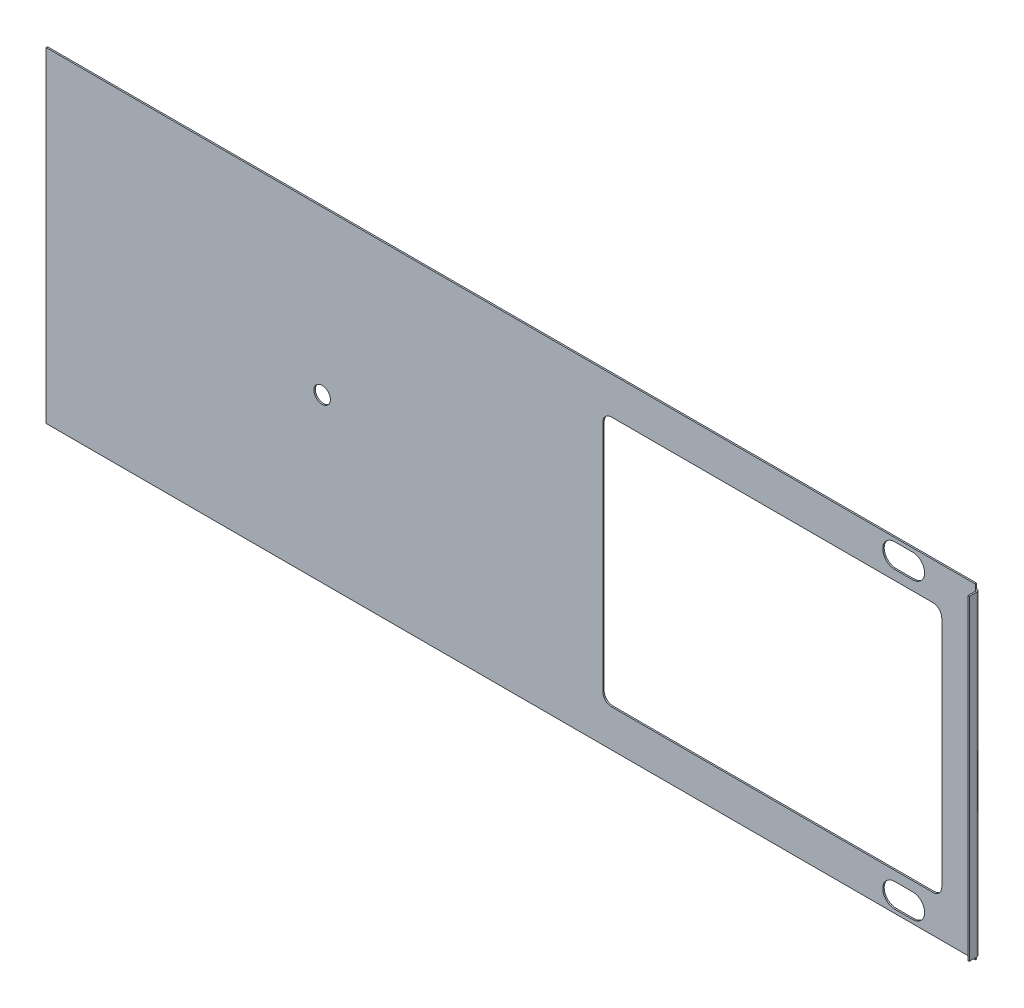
ISO-10303-21;
HEADER;
FILE_DESCRIPTION(('STEP AP214'),'2;1');
FILE_NAME('part.step','',(''),(''),'','','');
FILE_SCHEMA(('AUTOMOTIVE_DESIGN { 1 0 10303 214 1 1 1 1 }'));
ENDSEC;
DATA;
#1=APPLICATION_CONTEXT('core data for automotive mechanical design processes');
#2=APPLICATION_PROTOCOL_DEFINITION('international standard','automotive_design',2000,#1);
#3=PRODUCT_CONTEXT('',#1,'mechanical');
#4=PRODUCT('Part','Part','',(#3));
#5=PRODUCT_RELATED_PRODUCT_CATEGORY('part','',(#4));
#6=PRODUCT_DEFINITION_FORMATION('','',#4);
#7=PRODUCT_DEFINITION_CONTEXT('part definition',#1,'design');
#8=PRODUCT_DEFINITION('design','',#6,#7);
#9=PRODUCT_DEFINITION_SHAPE('','',#8);
#10=(LENGTH_UNIT() NAMED_UNIT(*) SI_UNIT(.MILLI.,.METRE.));
#11=(NAMED_UNIT(*) PLANE_ANGLE_UNIT() SI_UNIT($,.RADIAN.));
#12=(NAMED_UNIT(*) SI_UNIT($,.STERADIAN.) SOLID_ANGLE_UNIT());
#13=UNCERTAINTY_MEASURE_WITH_UNIT(LENGTH_MEASURE(1.E-05),#10,'distance_accuracy_value','');
#14=(GEOMETRIC_REPRESENTATION_CONTEXT(3) GLOBAL_UNCERTAINTY_ASSIGNED_CONTEXT((#13)) GLOBAL_UNIT_ASSIGNED_CONTEXT((#10,
#11,#12)) REPRESENTATION_CONTEXT('',''));
#15=CARTESIAN_POINT('',(0.,0.,0.));
#16=DIRECTION('',(0.,0.,1.));
#17=DIRECTION('',(1.,0.,0.));
#18=AXIS2_PLACEMENT_3D('',#15,#16,#17);
#19=CARTESIAN_POINT('',(1842.4525,33.3375,0.));
#20=DIRECTION('',(0.,0.,1.));
#21=DIRECTION('',(1.,0.,0.));
#22=AXIS2_PLACEMENT_3D('',#19,#20,#21);
#23=CYLINDRICAL_SURFACE('',#22,25.4);
#24=DIRECTION('',(0.,0.,1.));
#25=VECTOR('',#24,1.);
#26=CARTESIAN_POINT('',(1842.4525,7.93750000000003,0.));
#27=LINE('',#26,#25);
#28=CARTESIAN_POINT('',(1842.4525,7.93750000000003,0.));
#29=VERTEX_POINT('',#28);
#30=CARTESIAN_POINT('',(1842.4525,7.93750000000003,3.048));
#31=VERTEX_POINT('',#30);
#32=EDGE_CURVE('E320',#29,#31,#27,.T.);
#33=ORIENTED_EDGE('',*,*,#32,.T.);
#34=CARTESIAN_POINT('',(1842.4525,33.3375,3.048));
#35=DIRECTION('',(0.,0.,1.));
#36=DIRECTION('',(1.,0.,0.));
#37=AXIS2_PLACEMENT_3D('',#34,#35,#36);
#38=CIRCLE('',#37,25.4);
#39=CARTESIAN_POINT('',(1842.4525,58.7375,3.048));
#40=VERTEX_POINT('',#39);
#41=EDGE_CURVE('E451',#31,#40,#38,.T.);
#42=ORIENTED_EDGE('',*,*,#41,.T.);
#43=DIRECTION('',(0.,0.,1.));
#44=VECTOR('',#43,1.);
#45=CARTESIAN_POINT('',(1842.4525,58.7375,0.));
#46=LINE('',#45,#44);
#47=CARTESIAN_POINT('',(1842.4525,58.7375,0.));
#48=VERTEX_POINT('',#47);
#49=EDGE_CURVE('E310',#48,#40,#46,.T.);
#50=ORIENTED_EDGE('',*,*,#49,.F.);
#51=CARTESIAN_POINT('',(1842.4525,33.3375,0.));
#52=DIRECTION('',(0.,0.,1.));
#53=DIRECTION('',(1.,0.,0.));
#54=AXIS2_PLACEMENT_3D('',#51,#52,#53);
#55=CIRCLE('',#54,25.4);
#56=EDGE_CURVE('E455',#29,#48,#55,.T.);
#57=ORIENTED_EDGE('',*,*,#56,.F.);
#58=EDGE_LOOP('',(#33,#42,#50,#57));
#59=FACE_BOUND('',#58,.T.);
#60=ADVANCED_FACE('F71',(#59),#23,.F.);
#61=CARTESIAN_POINT('',(1842.4525,658.8125,0.));
#62=DIRECTION('',(0.,0.,1.));
#63=DIRECTION('',(1.,0.,0.));
#64=AXIS2_PLACEMENT_3D('',#61,#62,#63);
#65=CYLINDRICAL_SURFACE('',#64,25.4);
#66=CARTESIAN_POINT('',(1842.4525,658.8125,0.));
#67=DIRECTION('',(0.,0.,-1.));
#68=DIRECTION('',(1.,0.,0.));
#69=AXIS2_PLACEMENT_3D('',#66,#67,#68);
#70=CIRCLE('',#69,25.4);
#71=CARTESIAN_POINT('',(1842.4525,684.2125,0.));
#72=VERTEX_POINT('',#71);
#73=CARTESIAN_POINT('',(1842.4525,633.4125,0.));
#74=VERTEX_POINT('',#73);
#75=EDGE_CURVE('E284',#72,#74,#70,.T.);
#76=ORIENTED_EDGE('',*,*,#75,.T.);
#77=DIRECTION('',(0.,0.,1.));
#78=VECTOR('',#77,1.);
#79=CARTESIAN_POINT('',(1842.4525,633.4125,0.));
#80=LINE('',#79,#78);
#81=CARTESIAN_POINT('',(1842.4525,633.4125,3.048));
#82=VERTEX_POINT('',#81);
#83=EDGE_CURVE('E301',#74,#82,#80,.T.);
#84=ORIENTED_EDGE('',*,*,#83,.T.);
#85=CARTESIAN_POINT('',(1842.4525,658.8125,3.048));
#86=DIRECTION('',(0.,0.,-1.));
#87=DIRECTION('',(1.,0.,0.));
#88=AXIS2_PLACEMENT_3D('',#85,#86,#87);
#89=CIRCLE('',#88,25.4);
#90=CARTESIAN_POINT('',(1842.4525,684.2125,3.048));
#91=VERTEX_POINT('',#90);
#92=EDGE_CURVE('E437',#91,#82,#89,.T.);
#93=ORIENTED_EDGE('',*,*,#92,.F.);
#94=DIRECTION('',(0.,0.,1.));
#95=VECTOR('',#94,1.);
#96=CARTESIAN_POINT('',(1842.4525,684.2125,0.));
#97=LINE('',#96,#95);
#98=EDGE_CURVE('E269',#72,#91,#97,.T.);
#99=ORIENTED_EDGE('',*,*,#98,.F.);
#100=EDGE_LOOP('',(#76,#84,#93,#99));
#101=FACE_BOUND('',#100,.T.);
#102=ADVANCED_FACE('F789',(#101),#65,.F.);
#103=CARTESIAN_POINT('',(1174.115,612.775,0.));
#104=DIRECTION('',(0.,1.,0.));
#105=DIRECTION('',(0.,0.,1.));
#106=AXIS2_PLACEMENT_3D('',#103,#104,#105);
#107=PLANE('',#106);
#108=DIRECTION('',(-1.,0.,0.));
#109=VECTOR('',#108,1.);
#110=CARTESIAN_POINT('',(1174.115,612.775,0.));
#111=LINE('',#110,#109);
#112=CARTESIAN_POINT('',(1885.315,612.775,0.));
#113=VERTEX_POINT('',#112);
#114=CARTESIAN_POINT('',(1202.69,612.775,0.));
#115=VERTEX_POINT('',#114);
#116=EDGE_CURVE('E480',#113,#115,#111,.T.);
#117=ORIENTED_EDGE('',*,*,#116,.F.);
#118=DIRECTION('',(0.,0.,1.));
#119=VECTOR('',#118,1.);
#120=CARTESIAN_POINT('',(1885.315,612.775,3.048));
#121=LINE('',#120,#119);
#122=CARTESIAN_POINT('',(1885.315,612.775,3.048));
#123=VERTEX_POINT('',#122);
#124=EDGE_CURVE('E571',#113,#123,#121,.T.);
#125=ORIENTED_EDGE('',*,*,#124,.T.);
#126=DIRECTION('',(-1.,0.,0.));
#127=VECTOR('',#126,1.);
#128=CARTESIAN_POINT('',(1174.115,612.775,3.048));
#129=LINE('',#128,#127);
#130=CARTESIAN_POINT('',(1202.69,612.775,3.048));
#131=VERTEX_POINT('',#130);
#132=EDGE_CURVE('E476',#123,#131,#129,.T.);
#133=ORIENTED_EDGE('',*,*,#132,.T.);
#134=DIRECTION('',(0.,0.,1.));
#135=VECTOR('',#134,1.);
#136=CARTESIAN_POINT('',(1202.69,612.775,0.));
#137=LINE('',#136,#135);
#138=EDGE_CURVE('E568',#131,#115,#137,.F.);
#139=ORIENTED_EDGE('',*,*,#138,.T.);
#140=EDGE_LOOP('',(#117,#125,#133,#139));
#141=FACE_BOUND('',#140,.T.);
#142=ADVANCED_FACE('F775',(#141),#107,.F.);
#143=CARTESIAN_POINT('',(1174.115,79.375,0.));
#144=DIRECTION('',(0.,-1.,0.));
#145=DIRECTION('',(0.,0.,-1.));
#146=AXIS2_PLACEMENT_3D('',#143,#144,#145);
#147=PLANE('',#146);
#148=DIRECTION('',(1.,0.,0.));
#149=VECTOR('',#148,1.);
#150=CARTESIAN_POINT('',(1174.115,79.375,3.048));
#151=LINE('',#150,#149);
#152=CARTESIAN_POINT('',(1202.69,79.375,3.048));
#153=VERTEX_POINT('',#152);
#154=CARTESIAN_POINT('',(1885.315,79.375,3.048));
#155=VERTEX_POINT('',#154);
#156=EDGE_CURVE('E467',#153,#155,#151,.T.);
#157=ORIENTED_EDGE('',*,*,#156,.T.);
#158=DIRECTION('',(0.,0.,1.));
#159=VECTOR('',#158,1.);
#160=CARTESIAN_POINT('',(1885.315,79.375,0.));
#161=LINE('',#160,#159);
#162=CARTESIAN_POINT('',(1885.315,79.375,0.));
#163=VERTEX_POINT('',#162);
#164=EDGE_CURVE('E557',#155,#163,#161,.F.);
#165=ORIENTED_EDGE('',*,*,#164,.T.);
#166=DIRECTION('',(1.,0.,0.));
#167=VECTOR('',#166,1.);
#168=CARTESIAN_POINT('',(1174.115,79.375,0.));
#169=LINE('',#168,#167);
#170=CARTESIAN_POINT('',(1202.69,79.375,0.));
#171=VERTEX_POINT('',#170);
#172=EDGE_CURVE('E471',#171,#163,#169,.T.);
#173=ORIENTED_EDGE('',*,*,#172,.F.);
#174=DIRECTION('',(0.,0.,-1.));
#175=VECTOR('',#174,1.);
#176=CARTESIAN_POINT('',(1202.69,79.375,3.048));
#177=LINE('',#176,#175);
#178=EDGE_CURVE('E554',#171,#153,#177,.F.);
#179=ORIENTED_EDGE('',*,*,#178,.T.);
#180=EDGE_LOOP('',(#157,#165,#173,#179));
#181=FACE_BOUND('',#180,.T.);
#182=ADVANCED_FACE('F808',(#181),#147,.F.);
#183=CARTESIAN_POINT('',(1982.0255,681.99,0.));
#184=DIRECTION('',(0.,-1.,0.));
#185=DIRECTION('',(0.,0.,-1.));
#186=AXIS2_PLACEMENT_3D('',#183,#184,#185);
#187=PLANE('',#186);
#188=DIRECTION('',(-1.,0.,0.));
#189=VECTOR('',#188,1.);
#190=CARTESIAN_POINT('',(0.,681.99,3.048));
#191=LINE('',#190,#189);
#192=CARTESIAN_POINT('',(1975.8025,681.99,3.04799999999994));
#193=VERTEX_POINT('',#192);
#194=CARTESIAN_POINT('',(1975.6755,681.99,3.048));
#195=VERTEX_POINT('',#194);
#196=EDGE_CURVE('E416',#193,#195,#191,.T.);
#197=ORIENTED_EDGE('',*,*,#196,.F.);
#198=DIRECTION('',(0.,0.,-1.));
#199=VECTOR('',#198,1.);
#200=CARTESIAN_POINT('',(1975.8025,681.99,3.04799999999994));
#201=LINE('',#200,#199);
#202=CARTESIAN_POINT('',(1975.8025,681.99,0.));
#203=VERTEX_POINT('',#202);
#204=EDGE_CURVE('E544',#193,#203,#201,.T.);
#205=ORIENTED_EDGE('',*,*,#204,.T.);
#206=DIRECTION('',(1.,0.,0.));
#207=VECTOR('',#206,1.);
#208=CARTESIAN_POINT('',(1982.0255,681.99,0.));
#209=LINE('',#208,#207);
#210=CARTESIAN_POINT('',(1975.6755,681.99,0.));
#211=VERTEX_POINT('',#210);
#212=EDGE_CURVE('E357',#211,#203,#209,.T.);
#213=ORIENTED_EDGE('',*,*,#212,.F.);
#214=DIRECTION('',(0.,0.,1.));
#215=VECTOR('',#214,1.);
#216=CARTESIAN_POINT('',(1975.6755,681.99,0.));
#217=LINE('',#216,#215);
#218=EDGE_CURVE('E368',#211,#195,#217,.T.);
#219=ORIENTED_EDGE('',*,*,#218,.T.);
#220=EDGE_LOOP('',(#197,#205,#213,#219));
#221=FACE_BOUND('',#220,.T.);
#222=ADVANCED_FACE('F814',(#221),#187,.F.);
#223=DIRECTION('',(0.,0.,1.));
#224=VECTOR('',#223,1.);
#225=CARTESIAN_POINT('',(1982.0255,681.99,0.));
#226=LINE('',#225,#224);
#227=CARTESIAN_POINT('',(1982.0255,681.99,6.22299999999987));
#228=VERTEX_POINT('',#227);
#229=CARTESIAN_POINT('',(1982.0255,681.99,22.2250000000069));
#230=VERTEX_POINT('',#229);
#231=EDGE_CURVE('E363',#228,#230,#226,.T.);
#232=ORIENTED_EDGE('',*,*,#231,.F.);
#233=DIRECTION('',(-1.,0.,0.));
#234=VECTOR('',#233,1.);
#235=CARTESIAN_POINT('',(1982.0255,681.99,6.22299999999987));
#236=LINE('',#235,#234);
#237=CARTESIAN_POINT('',(1978.9775,681.99,6.22299999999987));
#238=VERTEX_POINT('',#237);
#239=EDGE_CURVE('E541',#228,#238,#236,.T.);
#240=ORIENTED_EDGE('',*,*,#239,.T.);
#241=DIRECTION('',(0.,0.,1.));
#242=VECTOR('',#241,1.);
#243=CARTESIAN_POINT('',(1978.9775,681.99,0.));
#244=LINE('',#243,#242);
#245=CARTESIAN_POINT('',(1978.9775,681.99,22.225));
#246=VERTEX_POINT('',#245);
#247=EDGE_CURVE('E409',#238,#246,#244,.T.);
#248=ORIENTED_EDGE('',*,*,#247,.T.);
#249=DIRECTION('',(-1.,0.,0.));
#250=VECTOR('',#249,1.);
#251=CARTESIAN_POINT('',(1982.0255,681.99,22.225));
#252=LINE('',#251,#250);
#253=EDGE_CURVE('E531',#230,#246,#252,.T.);
#254=ORIENTED_EDGE('',*,*,#253,.F.);
#255=EDGE_LOOP('',(#232,#240,#248,#254));
#256=FACE_BOUND('',#255,.T.);
#257=ADVANCED_FACE('F870',(#256),#187,.F.);
#258=CARTESIAN_POINT('',(1982.0255,10.1599999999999,0.));
#259=DIRECTION('',(0.,1.,0.));
#260=DIRECTION('',(0.,0.,1.));
#261=AXIS2_PLACEMENT_3D('',#258,#259,#260);
#262=PLANE('',#261);
#263=DIRECTION('',(0.,0.,-1.));
#264=VECTOR('',#263,1.);
#265=CARTESIAN_POINT('',(1978.9775,10.1599999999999,0.));
#266=LINE('',#265,#264);
#267=CARTESIAN_POINT('',(1978.9775,10.1599999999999,22.2250000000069));
#268=VERTEX_POINT('',#267);
#269=CARTESIAN_POINT('',(1978.9775,10.1599999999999,6.22299999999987));
#270=VERTEX_POINT('',#269);
#271=EDGE_CURVE('E367',#268,#270,#266,.T.);
#272=ORIENTED_EDGE('',*,*,#271,.T.);
#273=DIRECTION('',(1.,0.,0.));
#274=VECTOR('',#273,1.);
#275=CARTESIAN_POINT('',(1978.9775,10.1599999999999,6.22299999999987));
#276=LINE('',#275,#274);
#277=CARTESIAN_POINT('',(1982.0255,10.1599999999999,6.22299999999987));
#278=VERTEX_POINT('',#277);
#279=EDGE_CURVE('E538',#270,#278,#276,.T.);
#280=ORIENTED_EDGE('',*,*,#279,.T.);
#281=DIRECTION('',(0.,0.,1.));
#282=VECTOR('',#281,1.);
#283=CARTESIAN_POINT('',(1982.0255,10.1599999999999,0.));
#284=LINE('',#283,#282);
#285=CARTESIAN_POINT('',(1982.0255,10.1599999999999,22.225));
#286=VERTEX_POINT('',#285);
#287=EDGE_CURVE('E374',#278,#286,#284,.T.);
#288=ORIENTED_EDGE('',*,*,#287,.T.);
#289=DIRECTION('',(-1.,0.,0.));
#290=VECTOR('',#289,1.);
#291=CARTESIAN_POINT('',(1982.0255,10.1599999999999,22.2250000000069));
#292=LINE('',#291,#290);
#293=EDGE_CURVE('E358',#286,#268,#292,.T.);
#294=ORIENTED_EDGE('',*,*,#293,.T.);
#295=EDGE_LOOP('',(#272,#280,#288,#294));
#296=FACE_BOUND('',#295,.T.);
#297=ADVANCED_FACE('F883',(#296),#262,.F.);
#298=DIRECTION('',(-1.,0.,0.));
#299=VECTOR('',#298,1.);
#300=CARTESIAN_POINT('',(1982.0255,10.1599999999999,0.));
#301=LINE('',#300,#299);
#302=CARTESIAN_POINT('',(1975.8025,10.1599999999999,0.));
#303=VERTEX_POINT('',#302);
#304=CARTESIAN_POINT('',(1975.6755,10.1599999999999,0.));
#305=VERTEX_POINT('',#304);
#306=EDGE_CURVE('E387',#303,#305,#301,.T.);
#307=ORIENTED_EDGE('',*,*,#306,.F.);
#308=DIRECTION('',(0.,0.,1.));
#309=VECTOR('',#308,1.);
#310=CARTESIAN_POINT('',(1975.8025,10.1599999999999,0.));
#311=LINE('',#310,#309);
#312=CARTESIAN_POINT('',(1975.8025,10.1599999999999,3.04799999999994));
#313=VERTEX_POINT('',#312);
#314=EDGE_CURVE('E535',#303,#313,#311,.T.);
#315=ORIENTED_EDGE('',*,*,#314,.T.);
#316=DIRECTION('',(1.,0.,0.));
#317=VECTOR('',#316,1.);
#318=CARTESIAN_POINT('',(0.,10.1599999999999,3.048));
#319=LINE('',#318,#317);
#320=CARTESIAN_POINT('',(1975.6755,10.1599999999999,3.048));
#321=VERTEX_POINT('',#320);
#322=EDGE_CURVE('E401',#321,#313,#319,.T.);
#323=ORIENTED_EDGE('',*,*,#322,.F.);
#324=DIRECTION('',(0.,0.,1.));
#325=VECTOR('',#324,1.);
#326=CARTESIAN_POINT('',(1975.6755,10.1599999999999,0.));
#327=LINE('',#326,#325);
#328=EDGE_CURVE('E378',#305,#321,#327,.T.);
#329=ORIENTED_EDGE('',*,*,#328,.F.);
#330=EDGE_LOOP('',(#307,#315,#323,#329));
#331=FACE_BOUND('',#330,.T.);
#332=ADVANCED_FACE('F833',(#331),#262,.F.);
#333=CARTESIAN_POINT('',(0.,0.,3.048));
#334=DIRECTION('',(1.,0.,0.));
#335=DIRECTION('',(0.,0.,-1.));
#336=AXIS2_PLACEMENT_3D('',#333,#334,#335);
#337=PLANE('',#336);
#338=DIRECTION('',(0.,-1.,0.));
#339=VECTOR('',#338,1.);
#340=CARTESIAN_POINT('',(0.,0.,0.));
#341=LINE('',#340,#339);
#342=CARTESIAN_POINT('',(0.,692.15,0.));
#343=VERTEX_POINT('',#342);
#344=CARTESIAN_POINT('',(0.,0.,0.));
#345=VERTEX_POINT('',#344);
#346=EDGE_CURVE('E484',#343,#345,#341,.T.);
#347=ORIENTED_EDGE('',*,*,#346,.T.);
#348=DIRECTION('',(0.,0.,-1.));
#349=VECTOR('',#348,1.);
#350=CARTESIAN_POINT('',(0.,0.,3.048));
#351=LINE('',#350,#349);
#352=CARTESIAN_POINT('',(0.,0.,3.048));
#353=VERTEX_POINT('',#352);
#354=EDGE_CURVE('E527',#353,#345,#351,.T.);
#355=ORIENTED_EDGE('',*,*,#354,.F.);
#356=DIRECTION('',(0.,-1.,0.));
#357=VECTOR('',#356,1.);
#358=CARTESIAN_POINT('',(0.,0.,3.048));
#359=LINE('',#358,#357);
#360=CARTESIAN_POINT('',(0.,692.15,3.048));
#361=VERTEX_POINT('',#360);
#362=EDGE_CURVE('E494',#361,#353,#359,.T.);
#363=ORIENTED_EDGE('',*,*,#362,.F.);
#364=DIRECTION('',(0.,0.,-1.));
#365=VECTOR('',#364,1.);
#366=CARTESIAN_POINT('',(0.,692.15,3.048));
#367=LINE('',#366,#365);
#368=EDGE_CURVE('E510',#361,#343,#367,.T.);
#369=ORIENTED_EDGE('',*,*,#368,.T.);
#370=EDGE_LOOP('',(#347,#355,#363,#369));
#371=FACE_BOUND('',#370,.T.);
#372=ADVANCED_FACE('F829',(#371),#337,.F.);
#373=CARTESIAN_POINT('',(0.,0.,3.048));
#374=DIRECTION('',(0.,1.,0.));
#375=DIRECTION('',(0.,0.,1.));
#376=AXIS2_PLACEMENT_3D('',#373,#374,#375);
#377=PLANE('',#376);
#378=DIRECTION('',(1.,0.,0.));
#379=VECTOR('',#378,1.);
#380=CARTESIAN_POINT('',(0.,0.,0.));
#381=LINE('',#380,#379);
#382=CARTESIAN_POINT('',(1975.6755,0.,0.));
#383=VERTEX_POINT('',#382);
#384=EDGE_CURVE('E514',#345,#383,#381,.T.);
#385=ORIENTED_EDGE('',*,*,#384,.T.);
#386=DIRECTION('',(0.,0.,1.));
#387=VECTOR('',#386,1.);
#388=CARTESIAN_POINT('',(1975.6755,0.,0.));
#389=LINE('',#388,#387);
#390=CARTESIAN_POINT('',(1975.6755,0.,3.048));
#391=VERTEX_POINT('',#390);
#392=EDGE_CURVE('E352',#383,#391,#389,.T.);
#393=ORIENTED_EDGE('',*,*,#392,.T.);
#394=DIRECTION('',(1.,0.,0.));
#395=VECTOR('',#394,1.);
#396=CARTESIAN_POINT('',(0.,0.,3.048));
#397=LINE('',#396,#395);
#398=EDGE_CURVE('E498',#353,#391,#397,.T.);
#399=ORIENTED_EDGE('',*,*,#398,.F.);
#400=ORIENTED_EDGE('',*,*,#354,.T.);
#401=EDGE_LOOP('',(#385,#393,#399,#400));
#402=FACE_BOUND('',#401,.T.);
#403=ADVANCED_FACE('F825',(#402),#377,.F.);
#404=CARTESIAN_POINT('',(0.,692.15,3.048));
#405=DIRECTION('',(0.,-1.,0.));
#406=DIRECTION('',(0.,0.,-1.));
#407=AXIS2_PLACEMENT_3D('',#404,#405,#406);
#408=PLANE('',#407);
#409=DIRECTION('',(-1.,0.,0.));
#410=VECTOR('',#409,1.);
#411=CARTESIAN_POINT('',(0.,692.15,3.048));
#412=LINE('',#411,#410);
#413=CARTESIAN_POINT('',(1975.6755,692.15,3.048));
#414=VERTEX_POINT('',#413);
#415=EDGE_CURVE('E507',#414,#361,#412,.T.);
#416=ORIENTED_EDGE('',*,*,#415,.F.);
#417=DIRECTION('',(0.,0.,1.));
#418=VECTOR('',#417,1.);
#419=CARTESIAN_POINT('',(1975.6755,692.15,0.));
#420=LINE('',#419,#418);
#421=CARTESIAN_POINT('',(1975.6755,692.15,0.));
#422=VERTEX_POINT('',#421);
#423=EDGE_CURVE('E362',#422,#414,#420,.T.);
#424=ORIENTED_EDGE('',*,*,#423,.F.);
#425=DIRECTION('',(-1.,0.,0.));
#426=VECTOR('',#425,1.);
#427=CARTESIAN_POINT('',(0.,692.15,0.));
#428=LINE('',#427,#426);
#429=EDGE_CURVE('E499',#422,#343,#428,.T.);
#430=ORIENTED_EDGE('',*,*,#429,.T.);
#431=ORIENTED_EDGE('',*,*,#368,.F.);
#432=EDGE_LOOP('',(#416,#424,#430,#431));
#433=FACE_BOUND('',#432,.T.);
#434=ADVANCED_FACE('F819',(#433),#408,.F.);
#435=CARTESIAN_POINT('',(0.,0.,3.048));
#436=DIRECTION('',(0.,0.,-1.));
#437=DIRECTION('',(-1.,0.,0.));
#438=AXIS2_PLACEMENT_3D('',#435,#436,#437);
#439=PLANE('',#438);
#440=ORIENTED_EDGE('',*,*,#92,.T.);
#441=DIRECTION('',(1.,0.,0.));
#442=VECTOR('',#441,1.);
#443=CARTESIAN_POINT('',(1842.4525,633.4125,3.048));
#444=LINE('',#443,#442);
#445=CARTESIAN_POINT('',(1804.3525,633.4125,3.048));
#446=VERTEX_POINT('',#445);
#447=EDGE_CURVE('E286',#446,#82,#444,.T.);
#448=ORIENTED_EDGE('',*,*,#447,.F.);
#449=CARTESIAN_POINT('',(1804.3525,658.8125,3.048));
#450=DIRECTION('',(0.,0.,1.));
#451=DIRECTION('',(1.,0.,0.));
#452=AXIS2_PLACEMENT_3D('',#449,#450,#451);
#453=CIRCLE('',#452,25.4);
#454=CARTESIAN_POINT('',(1804.3525,684.2125,3.048));
#455=VERTEX_POINT('',#454);
#456=EDGE_CURVE('E291',#455,#446,#453,.T.);
#457=ORIENTED_EDGE('',*,*,#456,.F.);
#458=DIRECTION('',(-1.,0.,0.));
#459=VECTOR('',#458,1.);
#460=CARTESIAN_POINT('',(1842.4525,684.2125,3.048));
#461=LINE('',#460,#459);
#462=EDGE_CURVE('E263',#91,#455,#461,.T.);
#463=ORIENTED_EDGE('',*,*,#462,.F.);
#464=EDGE_LOOP('',(#440,#448,#457,#463));
#465=FACE_BOUND('',#464,.T.);
#466=ORIENTED_EDGE('',*,*,#41,.F.);
#467=DIRECTION('',(1.,0.,0.));
#468=VECTOR('',#467,1.);
#469=CARTESIAN_POINT('',(1842.4525,7.93750000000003,3.048));
#470=LINE('',#469,#468);
#471=CARTESIAN_POINT('',(1804.3525,7.93750000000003,3.048));
#472=VERTEX_POINT('',#471);
#473=EDGE_CURVE('E324',#472,#31,#470,.T.);
#474=ORIENTED_EDGE('',*,*,#473,.F.);
#475=CARTESIAN_POINT('',(1804.3525,33.3375,3.048));
#476=DIRECTION('',(0.,0.,1.));
#477=DIRECTION('',(1.,0.,0.));
#478=AXIS2_PLACEMENT_3D('',#475,#476,#477);
#479=CIRCLE('',#478,25.4);
#480=CARTESIAN_POINT('',(1804.3525,58.7375,3.048));
#481=VERTEX_POINT('',#480);
#482=EDGE_CURVE('E327',#481,#472,#479,.T.);
#483=ORIENTED_EDGE('',*,*,#482,.F.);
#484=DIRECTION('',(-1.,0.,0.));
#485=VECTOR('',#484,1.);
#486=CARTESIAN_POINT('',(1842.4525,58.7375,3.048));
#487=LINE('',#486,#485);
#488=EDGE_CURVE('E298',#40,#481,#487,.T.);
#489=ORIENTED_EDGE('',*,*,#488,.F.);
#490=EDGE_LOOP('',(#466,#474,#483,#489));
#491=FACE_BOUND('',#490,.T.);
#492=CARTESIAN_POINT('',(587.0575,346.075,3.048));
#493=DIRECTION('',(0.,0.,1.));
#494=DIRECTION('',(1.,0.,0.));
#495=AXIS2_PLACEMENT_3D('',#492,#493,#494);
#496=CIRCLE('',#495,17.4625);
#497=CARTESIAN_POINT('',(604.52,346.075,3.048));
#498=VERTEX_POINT('',#497);
#499=EDGE_CURVE('E459',#498,#498,#496,.T.);
#500=ORIENTED_EDGE('',*,*,#499,.F.);
#501=EDGE_LOOP('',(#500));
#502=FACE_BOUND('',#501,.T.);
#503=ORIENTED_EDGE('',*,*,#156,.F.);
#504=CARTESIAN_POINT('',(1202.69,98.425,3.048));
#505=DIRECTION('',(0.,0.,-1.));
#506=DIRECTION('',(-1.,0.,0.));
#507=AXIS2_PLACEMENT_3D('',#504,#505,#506);
#508=CIRCLE('',#507,19.05);
#509=CARTESIAN_POINT('',(1183.64,98.425,3.048));
#510=VERTEX_POINT('',#509);
#511=EDGE_CURVE('E583',#153,#510,#508,.T.);
#512=ORIENTED_EDGE('',*,*,#511,.T.);
#513=DIRECTION('',(0.,-1.,0.));
#514=VECTOR('',#513,1.);
#515=CARTESIAN_POINT('',(1183.64,612.775,3.04800000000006));
#516=LINE('',#515,#514);
#517=CARTESIAN_POINT('',(1183.64,593.725,3.04800000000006));
#518=VERTEX_POINT('',#517);
#519=EDGE_CURVE('E348',#518,#510,#516,.T.);
#520=ORIENTED_EDGE('',*,*,#519,.F.);
#521=CARTESIAN_POINT('',(1202.69,593.725,3.048));
#522=DIRECTION('',(0.,0.,-1.));
#523=DIRECTION('',(-1.,0.,0.));
#524=AXIS2_PLACEMENT_3D('',#521,#522,#523);
#525=CIRCLE('',#524,19.05);
#526=EDGE_CURVE('E80',#518,#131,#525,.T.);
#527=ORIENTED_EDGE('',*,*,#526,.T.);
#528=ORIENTED_EDGE('',*,*,#132,.F.);
#529=CARTESIAN_POINT('',(1885.315,593.725,3.048));
#530=DIRECTION('',(0.,0.,-1.));
#531=DIRECTION('',(-1.,0.,0.));
#532=AXIS2_PLACEMENT_3D('',#529,#530,#531);
#533=CIRCLE('',#532,19.05);
#534=CARTESIAN_POINT('',(1904.365,593.725,3.048));
#535=VERTEX_POINT('',#534);
#536=EDGE_CURVE('E94',#123,#535,#533,.T.);
#537=ORIENTED_EDGE('',*,*,#536,.T.);
#538=DIRECTION('',(0.,1.,0.));
#539=VECTOR('',#538,1.);
#540=CARTESIAN_POINT('',(1904.365,612.775,3.048));
#541=LINE('',#540,#539);
#542=CARTESIAN_POINT('',(1904.365,98.4250000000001,3.048));
#543=VERTEX_POINT('',#542);
#544=EDGE_CURVE('E488',#543,#535,#541,.T.);
#545=ORIENTED_EDGE('',*,*,#544,.F.);
#546=CARTESIAN_POINT('',(1885.315,98.4250000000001,3.048));
#547=DIRECTION('',(0.,0.,-1.));
#548=DIRECTION('',(-1.,0.,0.));
#549=AXIS2_PLACEMENT_3D('',#546,#547,#548);
#550=CIRCLE('',#549,19.05);
#551=EDGE_CURVE('E574',#543,#155,#550,.T.);
#552=ORIENTED_EDGE('',*,*,#551,.T.);
#553=EDGE_LOOP('',(#503,#512,#520,#527,#528,#537,#545,#552));
#554=FACE_BOUND('',#553,.T.);
#555=DIRECTION('',(0.,1.,0.));
#556=VECTOR('',#555,1.);
#557=CARTESIAN_POINT('',(1975.8025,0.,3.048));
#558=LINE('',#557,#556);
#559=EDGE_CURVE('E503',#313,#193,#558,.T.);
#560=ORIENTED_EDGE('',*,*,#559,.T.);
#561=ORIENTED_EDGE('',*,*,#196,.T.);
#562=DIRECTION('',(0.,1.,0.));
#563=VECTOR('',#562,1.);
#564=CARTESIAN_POINT('',(1975.6755,0.,3.048));
#565=LINE('',#564,#563);
#566=EDGE_CURVE('E428',#195,#414,#565,.T.);
#567=ORIENTED_EDGE('',*,*,#566,.T.);
#568=ORIENTED_EDGE('',*,*,#415,.T.);
#569=ORIENTED_EDGE('',*,*,#362,.T.);
#570=ORIENTED_EDGE('',*,*,#398,.T.);
#571=DIRECTION('',(0.,1.,0.));
#572=VECTOR('',#571,1.);
#573=CARTESIAN_POINT('',(1975.6755,0.,3.048));
#574=LINE('',#573,#572);
#575=EDGE_CURVE('E424',#391,#321,#574,.T.);
#576=ORIENTED_EDGE('',*,*,#575,.T.);
#577=ORIENTED_EDGE('',*,*,#322,.T.);
#578=EDGE_LOOP('',(#560,#561,#567,#568,#569,#570,#576,#577));
#579=FACE_BOUND('',#578,.T.);
#580=ADVANCED_FACE('F816',(#465,#491,#502,#554,#579),#439,.F.);
#581=CARTESIAN_POINT('',(0.,0.,0.));
#582=DIRECTION('',(0.,0.,-1.));
#583=DIRECTION('',(-1.,0.,0.));
#584=AXIS2_PLACEMENT_3D('',#581,#582,#583);
#585=PLANE('',#584);
#586=DIRECTION('',(1.,0.,0.));
#587=VECTOR('',#586,1.);
#588=CARTESIAN_POINT('',(1842.4525,633.4125,0.));
#589=LINE('',#588,#587);
#590=CARTESIAN_POINT('',(1804.3525,633.4125,0.));
#591=VERTEX_POINT('',#590);
#592=EDGE_CURVE('E278',#591,#74,#589,.T.);
#593=ORIENTED_EDGE('',*,*,#592,.T.);
#594=ORIENTED_EDGE('',*,*,#75,.F.);
#595=DIRECTION('',(-1.,0.,0.));
#596=VECTOR('',#595,1.);
#597=CARTESIAN_POINT('',(1842.4525,684.2125,0.));
#598=LINE('',#597,#596);
#599=CARTESIAN_POINT('',(1804.3525,684.2125,0.));
#600=VERTEX_POINT('',#599);
#601=EDGE_CURVE('E260',#72,#600,#598,.T.);
#602=ORIENTED_EDGE('',*,*,#601,.T.);
#603=CARTESIAN_POINT('',(1804.3525,658.8125,0.));
#604=DIRECTION('',(0.,0.,1.));
#605=DIRECTION('',(1.,0.,0.));
#606=AXIS2_PLACEMENT_3D('',#603,#604,#605);
#607=CIRCLE('',#606,25.4);
#608=EDGE_CURVE('E272',#600,#591,#607,.T.);
#609=ORIENTED_EDGE('',*,*,#608,.T.);
#610=EDGE_LOOP('',(#593,#594,#602,#609));
#611=FACE_BOUND('',#610,.T.);
#612=DIRECTION('',(1.,0.,0.));
#613=VECTOR('',#612,1.);
#614=CARTESIAN_POINT('',(1842.4525,7.93750000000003,0.));
#615=LINE('',#614,#613);
#616=CARTESIAN_POINT('',(1804.3525,7.93750000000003,0.));
#617=VERTEX_POINT('',#616);
#618=EDGE_CURVE('E313',#617,#29,#615,.T.);
#619=ORIENTED_EDGE('',*,*,#618,.T.);
#620=ORIENTED_EDGE('',*,*,#56,.T.);
#621=DIRECTION('',(-1.,0.,0.));
#622=VECTOR('',#621,1.);
#623=CARTESIAN_POINT('',(1842.4525,58.7375,0.));
#624=LINE('',#623,#622);
#625=CARTESIAN_POINT('',(1804.3525,58.7375,0.));
#626=VERTEX_POINT('',#625);
#627=EDGE_CURVE('E328',#48,#626,#624,.T.);
#628=ORIENTED_EDGE('',*,*,#627,.T.);
#629=CARTESIAN_POINT('',(1804.3525,33.3375,0.));
#630=DIRECTION('',(0.,0.,1.));
#631=DIRECTION('',(1.,0.,0.));
#632=AXIS2_PLACEMENT_3D('',#629,#630,#631);
#633=CIRCLE('',#632,25.4);
#634=EDGE_CURVE('E338',#626,#617,#633,.T.);
#635=ORIENTED_EDGE('',*,*,#634,.T.);
#636=EDGE_LOOP('',(#619,#620,#628,#635));
#637=FACE_BOUND('',#636,.T.);
#638=ORIENTED_EDGE('',*,*,#212,.T.);
#639=DIRECTION('',(0.,1.,0.));
#640=VECTOR('',#639,1.);
#641=CARTESIAN_POINT('',(1975.8025,0.,0.));
#642=LINE('',#641,#640);
#643=EDGE_CURVE('E518',#303,#203,#642,.T.);
#644=ORIENTED_EDGE('',*,*,#643,.F.);
#645=ORIENTED_EDGE('',*,*,#306,.T.);
#646=DIRECTION('',(0.,-1.,0.));
#647=VECTOR('',#646,1.);
#648=CARTESIAN_POINT('',(1975.6755,0.,0.));
#649=LINE('',#648,#647);
#650=EDGE_CURVE('E377',#305,#383,#649,.T.);
#651=ORIENTED_EDGE('',*,*,#650,.T.);
#652=ORIENTED_EDGE('',*,*,#384,.F.);
#653=ORIENTED_EDGE('',*,*,#346,.F.);
#654=ORIENTED_EDGE('',*,*,#429,.F.);
#655=DIRECTION('',(0.,-1.,0.));
#656=VECTOR('',#655,1.);
#657=CARTESIAN_POINT('',(1975.6755,692.15,0.));
#658=LINE('',#657,#656);
#659=EDGE_CURVE('E353',#422,#211,#658,.T.);
#660=ORIENTED_EDGE('',*,*,#659,.T.);
#661=EDGE_LOOP('',(#638,#644,#645,#651,#652,#653,#654,#660));
#662=FACE_BOUND('',#661,.T.);
#663=CARTESIAN_POINT('',(587.0575,346.075,0.));
#664=DIRECTION('',(0.,0.,1.));
#665=DIRECTION('',(1.,0.,0.));
#666=AXIS2_PLACEMENT_3D('',#663,#664,#665);
#667=CIRCLE('',#666,17.4625);
#668=CARTESIAN_POINT('',(604.52,346.075,0.));
#669=VERTEX_POINT('',#668);
#670=EDGE_CURVE('E463',#669,#669,#667,.T.);
#671=ORIENTED_EDGE('',*,*,#670,.T.);
#672=EDGE_LOOP('',(#671));
#673=FACE_BOUND('',#672,.T.);
#674=DIRECTION('',(0.,1.,0.));
#675=VECTOR('',#674,1.);
#676=CARTESIAN_POINT('',(1904.365,612.775,0.));
#677=LINE('',#676,#675);
#678=CARTESIAN_POINT('',(1904.365,98.4250000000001,0.));
#679=VERTEX_POINT('',#678);
#680=CARTESIAN_POINT('',(1904.365,593.725,0.));
#681=VERTEX_POINT('',#680);
#682=EDGE_CURVE('E475',#679,#681,#677,.T.);
#683=ORIENTED_EDGE('',*,*,#682,.T.);
#684=CARTESIAN_POINT('',(1885.315,593.725,0.));
#685=DIRECTION('',(0.,0.,-1.));
#686=DIRECTION('',(-1.,0.,0.));
#687=AXIS2_PLACEMENT_3D('',#684,#685,#686);
#688=CIRCLE('',#687,19.05);
#689=EDGE_CURVE('E588',#681,#113,#688,.F.);
#690=ORIENTED_EDGE('',*,*,#689,.T.);
#691=ORIENTED_EDGE('',*,*,#116,.T.);
#692=CARTESIAN_POINT('',(1202.69,593.725,0.));
#693=DIRECTION('',(0.,0.,-1.));
#694=DIRECTION('',(-1.,0.,0.));
#695=AXIS2_PLACEMENT_3D('',#692,#693,#694);
#696=CIRCLE('',#695,19.05);
#697=CARTESIAN_POINT('',(1183.64,593.725,0.));
#698=VERTEX_POINT('',#697);
#699=EDGE_CURVE('E13',#115,#698,#696,.F.);
#700=ORIENTED_EDGE('',*,*,#699,.T.);
#701=DIRECTION('',(0.,1.,0.));
#702=VECTOR('',#701,1.);
#703=CARTESIAN_POINT('',(1183.64,612.775,0.));
#704=LINE('',#703,#702);
#705=CARTESIAN_POINT('',(1183.64,98.425,0.));
#706=VERTEX_POINT('',#705);
#707=EDGE_CURVE('E305',#706,#698,#704,.T.);
#708=ORIENTED_EDGE('',*,*,#707,.F.);
#709=CARTESIAN_POINT('',(1202.69,98.425,0.));
#710=DIRECTION('',(0.,0.,-1.));
#711=DIRECTION('',(-1.,0.,0.));
#712=AXIS2_PLACEMENT_3D('',#709,#710,#711);
#713=CIRCLE('',#712,19.05);
#714=EDGE_CURVE('E580',#706,#171,#713,.F.);
#715=ORIENTED_EDGE('',*,*,#714,.T.);
#716=ORIENTED_EDGE('',*,*,#172,.T.);
#717=CARTESIAN_POINT('',(1885.315,98.4250000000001,0.));
#718=DIRECTION('',(0.,0.,-1.));
#719=DIRECTION('',(-1.,0.,0.));
#720=AXIS2_PLACEMENT_3D('',#717,#718,#719);
#721=CIRCLE('',#720,19.05);
#722=EDGE_CURVE('E577',#163,#679,#721,.F.);
#723=ORIENTED_EDGE('',*,*,#722,.T.);
#724=EDGE_LOOP('',(#683,#690,#691,#700,#708,#715,#716,#723));
#725=FACE_BOUND('',#724,.T.);
#726=ADVANCED_FACE('F281',(#611,#637,#662,#673,#725),#585,.T.);
#727=CARTESIAN_POINT('',(1904.365,612.775,0.));
#728=DIRECTION('',(1.,0.,0.));
#729=DIRECTION('',(0.,0.,-1.));
#730=AXIS2_PLACEMENT_3D('',#727,#728,#729);
#731=PLANE('',#730);
#732=ORIENTED_EDGE('',*,*,#682,.F.);
#733=DIRECTION('',(0.,0.,1.));
#734=VECTOR('',#733,1.);
#735=CARTESIAN_POINT('',(1904.365,98.4250000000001,3.048));
#736=LINE('',#735,#734);
#737=EDGE_CURVE('E550',#679,#543,#736,.T.);
#738=ORIENTED_EDGE('',*,*,#737,.T.);
#739=ORIENTED_EDGE('',*,*,#544,.T.);
#740=DIRECTION('',(0.,0.,1.));
#741=VECTOR('',#740,1.);
#742=CARTESIAN_POINT('',(1904.365,593.725,0.));
#743=LINE('',#742,#741);
#744=EDGE_CURVE('E547',#535,#681,#743,.F.);
#745=ORIENTED_EDGE('',*,*,#744,.T.);
#746=EDGE_LOOP('',(#732,#738,#739,#745));
#747=FACE_BOUND('',#746,.T.);
#748=ADVANCED_FACE('F804',(#747),#731,.F.);
#749=CARTESIAN_POINT('',(587.0575,346.075,0.));
#750=DIRECTION('',(0.,0.,1.));
#751=DIRECTION('',(1.,0.,0.));
#752=AXIS2_PLACEMENT_3D('',#749,#750,#751);
#753=CYLINDRICAL_SURFACE('',#752,17.4625);
#754=CARTESIAN_POINT('',(604.52,346.075,0.));
#755=CARTESIAN_POINT('',(604.52,346.075,0.03175));
#756=CARTESIAN_POINT('',(604.52,346.075,0.0635));
#757=CARTESIAN_POINT('',(604.52,346.075,0.127));
#758=CARTESIAN_POINT('',(604.52,346.075,0.15875));
#759=CARTESIAN_POINT('',(604.52,346.075,0.22225));
#760=CARTESIAN_POINT('',(604.52,346.075,0.254));
#761=CARTESIAN_POINT('',(604.52,346.075,0.3175));
#762=CARTESIAN_POINT('',(604.52,346.075,0.34925));
#763=CARTESIAN_POINT('',(604.52,346.075,0.41275));
#764=CARTESIAN_POINT('',(604.52,346.075,0.4445));
#765=CARTESIAN_POINT('',(604.52,346.075,0.508));
#766=CARTESIAN_POINT('',(604.52,346.075,0.53975));
#767=CARTESIAN_POINT('',(604.52,346.075,0.60325));
#768=CARTESIAN_POINT('',(604.52,346.075,0.635));
#769=CARTESIAN_POINT('',(604.52,346.075,0.6985));
#770=CARTESIAN_POINT('',(604.52,346.075,0.73025));
#771=CARTESIAN_POINT('',(604.52,346.075,0.79375));
#772=CARTESIAN_POINT('',(604.52,346.075,0.8255));
#773=CARTESIAN_POINT('',(604.52,346.075,0.889));
#774=CARTESIAN_POINT('',(604.52,346.075,0.92075));
#775=CARTESIAN_POINT('',(604.52,346.075,0.98425));
#776=CARTESIAN_POINT('',(604.52,346.075,1.016));
#777=CARTESIAN_POINT('',(604.52,346.075,1.0795));
#778=CARTESIAN_POINT('',(604.52,346.075,1.11125));
#779=CARTESIAN_POINT('',(604.52,346.075,1.17475));
#780=CARTESIAN_POINT('',(604.52,346.075,1.2065));
#781=CARTESIAN_POINT('',(604.52,346.075,1.27));
#782=CARTESIAN_POINT('',(604.52,346.075,1.30175));
#783=CARTESIAN_POINT('',(604.52,346.075,1.36525));
#784=CARTESIAN_POINT('',(604.52,346.075,1.397));
#785=CARTESIAN_POINT('',(604.52,346.075,1.4605));
#786=CARTESIAN_POINT('',(604.52,346.075,1.49225));
#787=CARTESIAN_POINT('',(604.52,346.075,1.55575));
#788=CARTESIAN_POINT('',(604.52,346.075,1.5875));
#789=CARTESIAN_POINT('',(604.52,346.075,1.651));
#790=CARTESIAN_POINT('',(604.52,346.075,1.68275));
#791=CARTESIAN_POINT('',(604.52,346.075,1.74625));
#792=CARTESIAN_POINT('',(604.52,346.075,1.778));
#793=CARTESIAN_POINT('',(604.52,346.075,1.8415));
#794=CARTESIAN_POINT('',(604.52,346.075,1.87325));
#795=CARTESIAN_POINT('',(604.52,346.075,1.93675));
#796=CARTESIAN_POINT('',(604.52,346.075,1.9685));
#797=CARTESIAN_POINT('',(604.52,346.075,2.032));
#798=CARTESIAN_POINT('',(604.52,346.075,2.06375));
#799=CARTESIAN_POINT('',(604.52,346.075,2.12725));
#800=CARTESIAN_POINT('',(604.52,346.075,2.159));
#801=CARTESIAN_POINT('',(604.52,346.075,2.2225));
#802=CARTESIAN_POINT('',(604.52,346.075,2.25425));
#803=CARTESIAN_POINT('',(604.52,346.075,2.31775));
#804=CARTESIAN_POINT('',(604.52,346.075,2.3495));
#805=CARTESIAN_POINT('',(604.52,346.075,2.413));
#806=CARTESIAN_POINT('',(604.52,346.075,2.44475));
#807=CARTESIAN_POINT('',(604.52,346.075,2.50825));
#808=CARTESIAN_POINT('',(604.52,346.075,2.54));
#809=CARTESIAN_POINT('',(604.52,346.075,2.6035));
#810=CARTESIAN_POINT('',(604.52,346.075,2.63525));
#811=CARTESIAN_POINT('',(604.52,346.075,2.69875));
#812=CARTESIAN_POINT('',(604.52,346.075,2.7305));
#813=CARTESIAN_POINT('',(604.52,346.075,2.794));
#814=CARTESIAN_POINT('',(604.52,346.075,2.82575));
#815=CARTESIAN_POINT('',(604.52,346.075,2.88925));
#816=CARTESIAN_POINT('',(604.52,346.075,2.921));
#817=CARTESIAN_POINT('',(604.52,346.075,2.9845));
#818=CARTESIAN_POINT('',(604.52,346.075,3.01625));
#819=CARTESIAN_POINT('',(604.52,346.075,3.048));
#820=B_SPLINE_CURVE_WITH_KNOTS('',3,(#754,#755,#756,#757,#758,#759,#760,#761,#762,#763,#764,
#765,#766,#767,#768,#769,#770,#771,#772,#773,#774,#775,#776,#777,#778,#779,#780,#781,#782,#783,
#784,#785,#786,#787,#788,#789,#790,#791,#792,#793,#794,#795,#796,#797,#798,#799,#800,#801,#802,
#803,#804,#805,#806,#807,#808,#809,#810,#811,#812,#813,#814,#815,#816,#817,#818,#819),
.UNSPECIFIED.,.F.,.F.,(4,2,2,2,2,2,2,2,2,2,2,2,2,2,2,2,2,2,2,2,2,2,2,2,2,2,2,2,2,2,2,2,4),(0.,
0.09525,0.1905,0.28575,0.381,0.47625,0.5715,0.66675,0.762,0.85725,0.9525,1.04775,1.143,1.23825,
1.3335,1.42875,1.524,1.61925,1.7145,1.80975,1.905,2.00025,2.0955,2.19075,2.286,2.38125,2.4765,
2.57175,2.667,2.76225,2.8575,2.95275,3.048),.UNSPECIFIED.);
#821=EDGE_CURVE('BSEAM800',#669,#498,#820,.T.);
#822=ORIENTED_EDGE('',*,*,#670,.F.);
#823=ORIENTED_EDGE('',*,*,#499,.T.);
#824=ORIENTED_EDGE('',*,*,#821,.T.);
#825=ORIENTED_EDGE('',*,*,#821,.F.);
#826=EDGE_LOOP('',(#822,#824,#823,#825));
#827=FACE_BOUND('',#826,.T.);
#828=ADVANCED_FACE('F800',(#827),#753,.F.);
#829=CARTESIAN_POINT('',(1975.8025,692.15,6.22299999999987));
#830=DIRECTION('',(0.,1.,0.));
#831=DIRECTION('',(1.,0.,0.));
#832=AXIS2_PLACEMENT_3D('',#829,#830,#831);
#833=CYLINDRICAL_SURFACE('',#832,6.22299999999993);
#834=CARTESIAN_POINT('',(1975.8025,681.99,6.22299999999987));
#835=DIRECTION('',(0.,-1.,0.));
#836=DIRECTION('',(0.,0.,-1.));
#837=AXIS2_PLACEMENT_3D('',#834,#835,#836);
#838=CIRCLE('',#837,6.22299999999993);
#839=EDGE_CURVE('E420',#228,#203,#838,.F.);
#840=ORIENTED_EDGE('',*,*,#839,.F.);
#841=DIRECTION('',(0.,1.,0.));
#842=VECTOR('',#841,1.);
#843=CARTESIAN_POINT('',(1982.0255,0.,6.22299999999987));
#844=LINE('',#843,#842);
#845=EDGE_CURVE('E442',#228,#278,#844,.F.);
#846=ORIENTED_EDGE('',*,*,#845,.T.);
#847=CARTESIAN_POINT('',(1975.8025,10.1599999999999,6.22299999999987));
#848=DIRECTION('',(0.,1.,0.));
#849=DIRECTION('',(0.,0.,1.));
#850=AXIS2_PLACEMENT_3D('',#847,#848,#849);
#851=CIRCLE('',#850,6.22299999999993);
#852=EDGE_CURVE('E405',#303,#278,#851,.F.);
#853=ORIENTED_EDGE('',*,*,#852,.F.);
#854=ORIENTED_EDGE('',*,*,#643,.T.);
#855=EDGE_LOOP('',(#840,#846,#853,#854));
#856=FACE_BOUND('',#855,.T.);
#857=ADVANCED_FACE('F803',(#856),#833,.T.);
#858=CARTESIAN_POINT('',(1975.8025,692.15,6.22299999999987));
#859=DIRECTION('',(0.,1.,0.));
#860=DIRECTION('',(1.,0.,0.));
#861=AXIS2_PLACEMENT_3D('',#858,#859,#860);
#862=CYLINDRICAL_SURFACE('',#861,3.17499999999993);
#863=DIRECTION('',(0.,1.,0.));
#864=VECTOR('',#863,1.);
#865=CARTESIAN_POINT('',(1978.9775,0.,6.22299999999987));
#866=LINE('',#865,#864);
#867=EDGE_CURVE('E432',#270,#238,#866,.T.);
#868=ORIENTED_EDGE('',*,*,#867,.T.);
#869=CARTESIAN_POINT('',(1975.8025,681.99,6.22299999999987));
#870=DIRECTION('',(0.,-1.,0.));
#871=DIRECTION('',(0.,0.,-1.));
#872=AXIS2_PLACEMENT_3D('',#869,#870,#871);
#873=CIRCLE('',#872,3.17499999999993);
#874=EDGE_CURVE('E412',#238,#193,#873,.F.);
#875=ORIENTED_EDGE('',*,*,#874,.T.);
#876=ORIENTED_EDGE('',*,*,#559,.F.);
#877=CARTESIAN_POINT('',(1975.8025,10.1599999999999,6.22299999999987));
#878=DIRECTION('',(0.,1.,0.));
#879=DIRECTION('',(0.,0.,1.));
#880=AXIS2_PLACEMENT_3D('',#877,#878,#879);
#881=CIRCLE('',#880,3.17499999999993);
#882=EDGE_CURVE('E397',#313,#270,#881,.F.);
#883=ORIENTED_EDGE('',*,*,#882,.T.);
#884=EDGE_LOOP('',(#868,#875,#876,#883));
#885=FACE_BOUND('',#884,.T.);
#886=ADVANCED_FACE('F892',(#885),#862,.F.);
#887=CARTESIAN_POINT('',(1982.0255,0.,0.));
#888=DIRECTION('',(-1.,0.,0.));
#889=DIRECTION('',(0.,0.,1.));
#890=AXIS2_PLACEMENT_3D('',#887,#888,#889);
#891=PLANE('',#890);
#892=ORIENTED_EDGE('',*,*,#845,.F.);
#893=ORIENTED_EDGE('',*,*,#231,.T.);
#894=DIRECTION('',(0.,-1.,0.));
#895=VECTOR('',#894,1.);
#896=CARTESIAN_POINT('',(1982.0255,0.,22.225));
#897=LINE('',#896,#895);
#898=EDGE_CURVE('E433',#230,#286,#897,.T.);
#899=ORIENTED_EDGE('',*,*,#898,.T.);
#900=ORIENTED_EDGE('',*,*,#287,.F.);
#901=EDGE_LOOP('',(#892,#893,#899,#900));
#902=FACE_BOUND('',#901,.T.);
#903=ADVANCED_FACE('F888',(#902),#891,.F.);
#904=CARTESIAN_POINT('',(1978.9775,0.,0.));
#905=DIRECTION('',(-1.,0.,0.));
#906=DIRECTION('',(0.,0.,1.));
#907=AXIS2_PLACEMENT_3D('',#904,#905,#906);
#908=PLANE('',#907);
#909=ORIENTED_EDGE('',*,*,#247,.F.);
#910=ORIENTED_EDGE('',*,*,#867,.F.);
#911=ORIENTED_EDGE('',*,*,#271,.F.);
#912=DIRECTION('',(0.,1.,0.));
#913=VECTOR('',#912,1.);
#914=CARTESIAN_POINT('',(1978.9775,0.,22.225));
#915=LINE('',#914,#913);
#916=EDGE_CURVE('E438',#246,#268,#915,.F.);
#917=ORIENTED_EDGE('',*,*,#916,.F.);
#918=EDGE_LOOP('',(#909,#910,#911,#917));
#919=FACE_BOUND('',#918,.T.);
#920=ADVANCED_FACE('F891',(#919),#908,.T.);
#921=CARTESIAN_POINT('',(1982.0255,0.,22.225));
#922=DIRECTION('',(0.,0.,-1.));
#923=DIRECTION('',(-1.,0.,0.));
#924=AXIS2_PLACEMENT_3D('',#921,#922,#923);
#925=PLANE('',#924);
#926=ORIENTED_EDGE('',*,*,#898,.F.);
#927=ORIENTED_EDGE('',*,*,#253,.T.);
#928=ORIENTED_EDGE('',*,*,#916,.T.);
#929=ORIENTED_EDGE('',*,*,#293,.F.);
#930=EDGE_LOOP('',(#926,#927,#928,#929));
#931=FACE_BOUND('',#930,.T.);
#932=ADVANCED_FACE('F886',(#931),#925,.F.);
#933=CARTESIAN_POINT('',(1975.6755,0.,0.));
#934=DIRECTION('',(-1.,0.,0.));
#935=DIRECTION('',(0.,0.,1.));
#936=AXIS2_PLACEMENT_3D('',#933,#934,#935);
#937=PLANE('',#936);
#938=ORIENTED_EDGE('',*,*,#392,.F.);
#939=ORIENTED_EDGE('',*,*,#650,.F.);
#940=ORIENTED_EDGE('',*,*,#328,.T.);
#941=ORIENTED_EDGE('',*,*,#575,.F.);
#942=EDGE_LOOP('',(#938,#939,#940,#941));
#943=FACE_BOUND('',#942,.T.);
#944=ADVANCED_FACE('F881',(#943),#937,.F.);
#945=ORIENTED_EDGE('',*,*,#279,.F.);
#946=ORIENTED_EDGE('',*,*,#882,.F.);
#947=ORIENTED_EDGE('',*,*,#314,.F.);
#948=ORIENTED_EDGE('',*,*,#852,.T.);
#949=EDGE_LOOP('',(#945,#946,#947,#948));
#950=FACE_BOUND('',#949,.T.);
#951=ADVANCED_FACE('F877',(#950),#262,.F.);
#952=CARTESIAN_POINT('',(1975.6755,692.15,0.));
#953=DIRECTION('',(-1.,0.,0.));
#954=DIRECTION('',(0.,0.,1.));
#955=AXIS2_PLACEMENT_3D('',#952,#953,#954);
#956=PLANE('',#955);
#957=ORIENTED_EDGE('',*,*,#218,.F.);
#958=ORIENTED_EDGE('',*,*,#659,.F.);
#959=ORIENTED_EDGE('',*,*,#423,.T.);
#960=ORIENTED_EDGE('',*,*,#566,.F.);
#961=EDGE_LOOP('',(#957,#958,#959,#960));
#962=FACE_BOUND('',#961,.T.);
#963=ADVANCED_FACE('F867',(#962),#956,.F.);
#964=ORIENTED_EDGE('',*,*,#204,.F.);
#965=ORIENTED_EDGE('',*,*,#874,.F.);
#966=ORIENTED_EDGE('',*,*,#239,.F.);
#967=ORIENTED_EDGE('',*,*,#839,.T.);
#968=EDGE_LOOP('',(#964,#965,#966,#967));
#969=FACE_BOUND('',#968,.T.);
#970=ADVANCED_FACE('F860',(#969),#187,.F.);
#971=CARTESIAN_POINT('',(1183.64,0.,0.));
#972=DIRECTION('',(-1.,0.,0.));
#973=DIRECTION('',(0.,0.,1.));
#974=AXIS2_PLACEMENT_3D('',#971,#972,#973);
#975=PLANE('',#974);
#976=ORIENTED_EDGE('',*,*,#519,.T.);
#977=DIRECTION('',(0.,0.,-1.));
#978=VECTOR('',#977,1.);
#979=CARTESIAN_POINT('',(1183.64,98.425,0.));
#980=LINE('',#979,#978);
#981=EDGE_CURVE('E564',#510,#706,#980,.T.);
#982=ORIENTED_EDGE('',*,*,#981,.T.);
#983=ORIENTED_EDGE('',*,*,#707,.T.);
#984=DIRECTION('',(0.,0.,1.));
#985=VECTOR('',#984,1.);
#986=CARTESIAN_POINT('',(1183.64,593.725,3.048));
#987=LINE('',#986,#985);
#988=EDGE_CURVE('E560',#698,#518,#987,.T.);
#989=ORIENTED_EDGE('',*,*,#988,.T.);
#990=EDGE_LOOP('',(#976,#982,#983,#989));
#991=FACE_BOUND('',#990,.T.);
#992=ADVANCED_FACE('F855',(#991),#975,.F.);
#993=CARTESIAN_POINT('',(1842.4525,633.4125,0.));
#994=DIRECTION('',(0.,-1.,0.));
#995=DIRECTION('',(0.,0.,-1.));
#996=AXIS2_PLACEMENT_3D('',#993,#994,#995);
#997=PLANE('',#996);
#998=ORIENTED_EDGE('',*,*,#447,.T.);
#999=ORIENTED_EDGE('',*,*,#83,.F.);
#1000=ORIENTED_EDGE('',*,*,#592,.F.);
#1001=DIRECTION('',(0.,0.,1.));
#1002=VECTOR('',#1001,1.);
#1003=CARTESIAN_POINT('',(1804.3525,633.4125,0.));
#1004=LINE('',#1003,#1002);
#1005=EDGE_CURVE('E268',#591,#446,#1004,.T.);
#1006=ORIENTED_EDGE('',*,*,#1005,.T.);
#1007=EDGE_LOOP('',(#998,#999,#1000,#1006));
#1008=FACE_BOUND('',#1007,.T.);
#1009=ADVANCED_FACE('F859',(#1008),#997,.F.);
#1010=CARTESIAN_POINT('',(1804.3525,658.8125,0.));
#1011=DIRECTION('',(0.,0.,1.));
#1012=DIRECTION('',(1.,0.,0.));
#1013=AXIS2_PLACEMENT_3D('',#1010,#1011,#1012);
#1014=CYLINDRICAL_SURFACE('',#1013,25.4);
#1015=ORIENTED_EDGE('',*,*,#456,.T.);
#1016=ORIENTED_EDGE('',*,*,#1005,.F.);
#1017=ORIENTED_EDGE('',*,*,#608,.F.);
#1018=DIRECTION('',(0.,0.,1.));
#1019=VECTOR('',#1018,1.);
#1020=CARTESIAN_POINT('',(1804.3525,684.2125,0.));
#1021=LINE('',#1020,#1019);
#1022=EDGE_CURVE('E256',#600,#455,#1021,.T.);
#1023=ORIENTED_EDGE('',*,*,#1022,.T.);
#1024=EDGE_LOOP('',(#1015,#1016,#1017,#1023));
#1025=FACE_BOUND('',#1024,.T.);
#1026=ADVANCED_FACE('F273',(#1025),#1014,.F.);
#1027=CARTESIAN_POINT('',(1842.4525,684.2125,0.));
#1028=DIRECTION('',(0.,1.,0.));
#1029=DIRECTION('',(0.,0.,1.));
#1030=AXIS2_PLACEMENT_3D('',#1027,#1028,#1029);
#1031=PLANE('',#1030);
#1032=ORIENTED_EDGE('',*,*,#462,.T.);
#1033=ORIENTED_EDGE('',*,*,#1022,.F.);
#1034=ORIENTED_EDGE('',*,*,#601,.F.);
#1035=ORIENTED_EDGE('',*,*,#98,.T.);
#1036=EDGE_LOOP('',(#1032,#1033,#1034,#1035));
#1037=FACE_BOUND('',#1036,.T.);
#1038=ADVANCED_FACE('F258',(#1037),#1031,.F.);
#1039=CARTESIAN_POINT('',(1842.4525,7.93750000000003,0.));
#1040=DIRECTION('',(0.,-1.,0.));
#1041=DIRECTION('',(1.,0.,0.));
#1042=AXIS2_PLACEMENT_3D('',#1039,#1040,#1041);
#1043=PLANE('',#1042);
#1044=ORIENTED_EDGE('',*,*,#473,.T.);
#1045=ORIENTED_EDGE('',*,*,#32,.F.);
#1046=ORIENTED_EDGE('',*,*,#618,.F.);
#1047=DIRECTION('',(0.,0.,1.));
#1048=VECTOR('',#1047,1.);
#1049=CARTESIAN_POINT('',(1804.3525,7.93750000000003,0.));
#1050=LINE('',#1049,#1048);
#1051=EDGE_CURVE('E317',#617,#472,#1050,.T.);
#1052=ORIENTED_EDGE('',*,*,#1051,.T.);
#1053=EDGE_LOOP('',(#1044,#1045,#1046,#1052));
#1054=FACE_BOUND('',#1053,.T.);
#1055=ADVANCED_FACE('F872',(#1054),#1043,.F.);
#1056=CARTESIAN_POINT('',(1804.3525,33.3375,0.));
#1057=DIRECTION('',(0.,0.,1.));
#1058=DIRECTION('',(1.,0.,0.));
#1059=AXIS2_PLACEMENT_3D('',#1056,#1057,#1058);
#1060=CYLINDRICAL_SURFACE('',#1059,25.4);
#1061=ORIENTED_EDGE('',*,*,#482,.T.);
#1062=ORIENTED_EDGE('',*,*,#1051,.F.);
#1063=ORIENTED_EDGE('',*,*,#634,.F.);
#1064=DIRECTION('',(0.,0.,1.));
#1065=VECTOR('',#1064,1.);
#1066=CARTESIAN_POINT('',(1804.3525,58.7375,0.));
#1067=LINE('',#1066,#1065);
#1068=EDGE_CURVE('E314',#626,#481,#1067,.T.);
#1069=ORIENTED_EDGE('',*,*,#1068,.T.);
#1070=EDGE_LOOP('',(#1061,#1062,#1063,#1069));
#1071=FACE_BOUND('',#1070,.T.);
#1072=ADVANCED_FACE('F842',(#1071),#1060,.F.);
#1073=CARTESIAN_POINT('',(1842.4525,58.7375,0.));
#1074=DIRECTION('',(0.,1.,0.));
#1075=DIRECTION('',(-1.,0.,0.));
#1076=AXIS2_PLACEMENT_3D('',#1073,#1074,#1075);
#1077=PLANE('',#1076);
#1078=ORIENTED_EDGE('',*,*,#488,.T.);
#1079=ORIENTED_EDGE('',*,*,#1068,.F.);
#1080=ORIENTED_EDGE('',*,*,#627,.F.);
#1081=ORIENTED_EDGE('',*,*,#49,.T.);
#1082=EDGE_LOOP('',(#1078,#1079,#1080,#1081));
#1083=FACE_BOUND('',#1082,.T.);
#1084=ADVANCED_FACE('F836',(#1083),#1077,.F.);
#1085=CARTESIAN_POINT('',(1885.315,98.4250000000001,0.));
#1086=DIRECTION('',(0.,0.,-1.));
#1087=DIRECTION('',(-1.,0.,0.));
#1088=AXIS2_PLACEMENT_3D('',#1085,#1086,#1087);
#1089=CYLINDRICAL_SURFACE('',#1088,19.05);
#1090=ORIENTED_EDGE('',*,*,#722,.F.);
#1091=ORIENTED_EDGE('',*,*,#164,.F.);
#1092=ORIENTED_EDGE('',*,*,#551,.F.);
#1093=ORIENTED_EDGE('',*,*,#737,.F.);
#1094=EDGE_LOOP('',(#1090,#1091,#1092,#1093));
#1095=FACE_BOUND('',#1094,.T.);
#1096=ADVANCED_FACE('F785',(#1095),#1089,.F.);
#1097=CARTESIAN_POINT('',(1202.69,98.425,0.));
#1098=DIRECTION('',(0.,0.,1.));
#1099=DIRECTION('',(1.,0.,0.));
#1100=AXIS2_PLACEMENT_3D('',#1097,#1098,#1099);
#1101=CYLINDRICAL_SURFACE('',#1100,19.05);
#1102=ORIENTED_EDGE('',*,*,#511,.F.);
#1103=ORIENTED_EDGE('',*,*,#178,.F.);
#1104=ORIENTED_EDGE('',*,*,#714,.F.);
#1105=ORIENTED_EDGE('',*,*,#981,.F.);
#1106=EDGE_LOOP('',(#1102,#1103,#1104,#1105));
#1107=FACE_BOUND('',#1106,.T.);
#1108=ADVANCED_FACE('F779',(#1107),#1101,.F.);
#1109=CARTESIAN_POINT('',(1885.315,593.725,0.));
#1110=DIRECTION('',(0.,0.,-1.));
#1111=DIRECTION('',(-1.,0.,0.));
#1112=AXIS2_PLACEMENT_3D('',#1109,#1110,#1111);
#1113=CYLINDRICAL_SURFACE('',#1112,19.05);
#1114=ORIENTED_EDGE('',*,*,#689,.F.);
#1115=ORIENTED_EDGE('',*,*,#744,.F.);
#1116=ORIENTED_EDGE('',*,*,#536,.F.);
#1117=ORIENTED_EDGE('',*,*,#124,.F.);
#1118=EDGE_LOOP('',(#1114,#1115,#1116,#1117));
#1119=FACE_BOUND('',#1118,.T.);
#1120=ADVANCED_FACE('F777',(#1119),#1113,.F.);
#1121=CARTESIAN_POINT('',(1202.69,593.725,0.));
#1122=DIRECTION('',(0.,0.,-1.));
#1123=DIRECTION('',(-1.,0.,0.));
#1124=AXIS2_PLACEMENT_3D('',#1121,#1122,#1123);
#1125=CYLINDRICAL_SURFACE('',#1124,19.05);
#1126=ORIENTED_EDGE('',*,*,#699,.F.);
#1127=ORIENTED_EDGE('',*,*,#138,.F.);
#1128=ORIENTED_EDGE('',*,*,#526,.F.);
#1129=ORIENTED_EDGE('',*,*,#988,.F.);
#1130=EDGE_LOOP('',(#1126,#1127,#1128,#1129));
#1131=FACE_BOUND('',#1130,.T.);
#1132=ADVANCED_FACE('F73',(#1131),#1125,.F.);
#1133=CLOSED_SHELL('',(#60,#102,#142,#182,#222,#257,#297,#332,#372,#403,#434,#580,#726,#748,
#828,#857,#886,#903,#920,#932,#944,#951,#963,#970,#992,#1009,#1026,#1038,#1055,#1072,#1084,
#1096,#1108,#1120,#1132));
#1134=MANIFOLD_SOLID_BREP('B2',#1133);
#1135=ADVANCED_BREP_SHAPE_REPRESENTATION('',(#18,#1134),#14);
#1136=SHAPE_DEFINITION_REPRESENTATION(#9,#1135);
ENDSEC;
END-ISO-10303-21;
